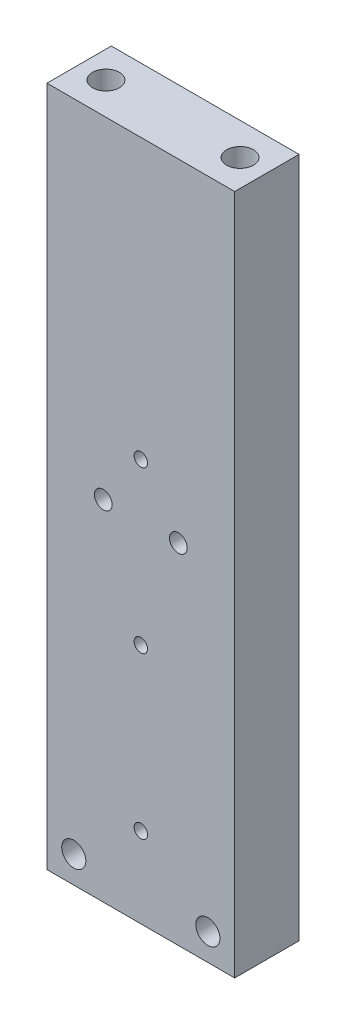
ISO-10303-21;
HEADER;
FILE_DESCRIPTION(('STEP AP214'),'2;1');
FILE_NAME('part.step','',(''),(''),'','','');
FILE_SCHEMA(('AUTOMOTIVE_DESIGN { 1 0 10303 214 1 1 1 1 }'));
ENDSEC;
DATA;
#1=APPLICATION_CONTEXT('core data for automotive mechanical design processes');
#2=APPLICATION_PROTOCOL_DEFINITION('international standard','automotive_design',2000,#1);
#3=PRODUCT_CONTEXT('',#1,'mechanical');
#4=PRODUCT('Part','Part','',(#3));
#5=PRODUCT_RELATED_PRODUCT_CATEGORY('part','',(#4));
#6=PRODUCT_DEFINITION_FORMATION('','',#4);
#7=PRODUCT_DEFINITION_CONTEXT('part definition',#1,'design');
#8=PRODUCT_DEFINITION('design','',#6,#7);
#9=PRODUCT_DEFINITION_SHAPE('','',#8);
#10=(LENGTH_UNIT() NAMED_UNIT(*) SI_UNIT(.MILLI.,.METRE.));
#11=(NAMED_UNIT(*) PLANE_ANGLE_UNIT() SI_UNIT($,.RADIAN.));
#12=(NAMED_UNIT(*) SI_UNIT($,.STERADIAN.) SOLID_ANGLE_UNIT());
#13=UNCERTAINTY_MEASURE_WITH_UNIT(LENGTH_MEASURE(1.E-05),#10,'distance_accuracy_value','');
#14=(GEOMETRIC_REPRESENTATION_CONTEXT(3) GLOBAL_UNCERTAINTY_ASSIGNED_CONTEXT((#13)) GLOBAL_UNIT_ASSIGNED_CONTEXT((#10,
#11,#12)) REPRESENTATION_CONTEXT('',''));
#15=CARTESIAN_POINT('',(0.,0.,0.));
#16=DIRECTION('',(0.,0.,1.));
#17=DIRECTION('',(1.,0.,0.));
#18=AXIS2_PLACEMENT_3D('',#15,#16,#17);
#19=CARTESIAN_POINT('',(-12.5,48.4999999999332,6.));
#20=DIRECTION('',(0.,1.,0.));
#21=DIRECTION('',(-1.,0.,0.));
#22=AXIS2_PLACEMENT_3D('',#19,#20,#21);
#23=CONICAL_SURFACE('',#22,2.49999999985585,1.02974425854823);
#24=CARTESIAN_POINT('',(-12.5,46.9978484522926,5.99999999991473));
#25=VERTEX_POINT('',#24);
#26=VERTEX_LOOP('',#25);
#27=FACE_BOUND('',#26,.T.);
#28=CARTESIAN_POINT('',(-12.5,48.5,6.));
#29=DIRECTION('',(0.,1.,0.));
#30=DIRECTION('',(0.,0.,1.));
#31=AXIS2_PLACEMENT_3D('',#28,#29,#30);
#32=CIRCLE('',#31,2.5);
#33=CARTESIAN_POINT('',(-12.5,48.5,8.5));
#34=VERTEX_POINT('',#33);
#35=EDGE_CURVE('E66',#34,#34,#32,.T.);
#36=ORIENTED_EDGE('',*,*,#35,.T.);
#37=EDGE_LOOP('',(#36));
#38=FACE_BOUND('',#37,.T.);
#39=ADVANCED_FACE('F17',(#27,#38),#23,.F.);
#40=CARTESIAN_POINT('',(12.5,48.4999999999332,6.));
#41=DIRECTION('',(0.,1.,0.));
#42=DIRECTION('',(-1.,0.,0.));
#43=AXIS2_PLACEMENT_3D('',#40,#41,#42);
#44=CONICAL_SURFACE('',#43,2.49999999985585,1.02974425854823);
#45=CARTESIAN_POINT('',(12.5,46.9978484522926,5.99999999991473));
#46=VERTEX_POINT('',#45);
#47=VERTEX_LOOP('',#46);
#48=FACE_BOUND('',#47,.T.);
#49=CARTESIAN_POINT('',(12.5,48.5,6.));
#50=DIRECTION('',(0.,1.,0.));
#51=DIRECTION('',(0.,0.,1.));
#52=AXIS2_PLACEMENT_3D('',#49,#50,#51);
#53=CIRCLE('',#52,2.5);
#54=CARTESIAN_POINT('',(12.5,48.5,8.5));
#55=VERTEX_POINT('',#54);
#56=EDGE_CURVE('E68',#55,#55,#53,.T.);
#57=ORIENTED_EDGE('',*,*,#56,.T.);
#58=EDGE_LOOP('',(#57));
#59=FACE_BOUND('',#58,.T.);
#60=ADVANCED_FACE('F63',(#48,#59),#44,.F.);
#61=CARTESIAN_POINT('',(-12.5,-58.5,4.));
#62=DIRECTION('',(0.,0.,-1.));
#63=DIRECTION('',(-1.,0.,0.));
#64=AXIS2_PLACEMENT_3D('',#61,#62,#63);
#65=CYLINDRICAL_SURFACE('',#64,3.75);
#66=CARTESIAN_POINT('',(-12.5,-58.5,4.));
#67=DIRECTION('',(0.,0.,-1.));
#68=DIRECTION('',(-1.,0.,0.));
#69=AXIS2_PLACEMENT_3D('',#66,#67,#68);
#70=CIRCLE('',#69,3.75);
#71=CARTESIAN_POINT('',(-16.25,-58.5,4.));
#72=VERTEX_POINT('',#71);
#73=EDGE_CURVE('E20',#72,#72,#70,.T.);
#74=ORIENTED_EDGE('',*,*,#73,.F.);
#75=EDGE_LOOP('',(#74));
#76=FACE_BOUND('',#75,.T.);
#77=CARTESIAN_POINT('',(-12.5,-58.5,0.));
#78=DIRECTION('',(0.,0.,-1.));
#79=DIRECTION('',(-1.,0.,0.));
#80=AXIS2_PLACEMENT_3D('',#77,#78,#79);
#81=CIRCLE('',#80,3.75);
#82=CARTESIAN_POINT('',(-16.25,-58.5,0.));
#83=VERTEX_POINT('',#82);
#84=EDGE_CURVE('E72',#83,#83,#81,.T.);
#85=ORIENTED_EDGE('',*,*,#84,.T.);
#86=EDGE_LOOP('',(#85));
#87=FACE_BOUND('',#86,.T.);
#88=ADVANCED_FACE('F135',(#76,#87),#65,.F.);
#89=CARTESIAN_POINT('',(12.5,-58.5,4.));
#90=DIRECTION('',(0.,0.,-1.));
#91=DIRECTION('',(-1.,0.,0.));
#92=AXIS2_PLACEMENT_3D('',#89,#90,#91);
#93=CYLINDRICAL_SURFACE('',#92,3.75);
#94=CARTESIAN_POINT('',(12.5,-58.5,4.));
#95=DIRECTION('',(0.,0.,-1.));
#96=DIRECTION('',(-1.,0.,0.));
#97=AXIS2_PLACEMENT_3D('',#94,#95,#96);
#98=CIRCLE('',#97,3.75);
#99=CARTESIAN_POINT('',(8.75000000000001,-58.5,4.));
#100=VERTEX_POINT('',#99);
#101=EDGE_CURVE('E69',#100,#100,#98,.T.);
#102=ORIENTED_EDGE('',*,*,#101,.F.);
#103=EDGE_LOOP('',(#102));
#104=FACE_BOUND('',#103,.T.);
#105=CARTESIAN_POINT('',(12.5,-58.5,0.));
#106=DIRECTION('',(0.,0.,-1.));
#107=DIRECTION('',(-1.,0.,0.));
#108=AXIS2_PLACEMENT_3D('',#105,#106,#107);
#109=CIRCLE('',#108,3.75);
#110=CARTESIAN_POINT('',(8.75000000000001,-58.5,0.));
#111=VERTEX_POINT('',#110);
#112=EDGE_CURVE('E129',#111,#111,#109,.T.);
#113=ORIENTED_EDGE('',*,*,#112,.T.);
#114=EDGE_LOOP('',(#113));
#115=FACE_BOUND('',#114,.T.);
#116=ADVANCED_FACE('F219',(#104,#115),#93,.F.);
#117=CARTESIAN_POINT('',(-12.5,-58.5,4.));
#118=DIRECTION('',(0.,0.,-1.));
#119=DIRECTION('',(-1.,0.,0.));
#120=AXIS2_PLACEMENT_3D('',#117,#118,#119);
#121=PLANE('',#120);
#122=CARTESIAN_POINT('',(-12.5,-58.5,4.));
#123=DIRECTION('',(0.,0.,-1.));
#124=DIRECTION('',(-1.,0.,0.));
#125=AXIS2_PLACEMENT_3D('',#122,#123,#124);
#126=CIRCLE('',#125,2.25);
#127=CARTESIAN_POINT('',(-14.75,-58.5,4.));
#128=VERTEX_POINT('',#127);
#129=EDGE_CURVE('E126',#128,#128,#126,.F.);
#130=ORIENTED_EDGE('',*,*,#129,.T.);
#131=EDGE_LOOP('',(#130));
#132=FACE_BOUND('',#131,.T.);
#133=ORIENTED_EDGE('',*,*,#73,.T.);
#134=EDGE_LOOP('',(#133));
#135=FACE_BOUND('',#134,.T.);
#136=ADVANCED_FACE('F215',(#132,#135),#121,.T.);
#137=CARTESIAN_POINT('',(12.5,-58.5,4.));
#138=DIRECTION('',(0.,0.,-1.));
#139=DIRECTION('',(-1.,0.,0.));
#140=AXIS2_PLACEMENT_3D('',#137,#138,#139);
#141=PLANE('',#140);
#142=CARTESIAN_POINT('',(12.5,-58.5,4.));
#143=DIRECTION('',(0.,0.,-1.));
#144=DIRECTION('',(-1.,0.,0.));
#145=AXIS2_PLACEMENT_3D('',#142,#143,#144);
#146=CIRCLE('',#145,2.25);
#147=CARTESIAN_POINT('',(10.25,-58.5,4.));
#148=VERTEX_POINT('',#147);
#149=EDGE_CURVE('E123',#148,#148,#146,.F.);
#150=ORIENTED_EDGE('',*,*,#149,.T.);
#151=EDGE_LOOP('',(#150));
#152=FACE_BOUND('',#151,.T.);
#153=ORIENTED_EDGE('',*,*,#101,.T.);
#154=EDGE_LOOP('',(#153));
#155=FACE_BOUND('',#154,.T.);
#156=ADVANCED_FACE('F212',(#152,#155),#141,.T.);
#157=CARTESIAN_POINT('',(-12.5,63.5,6.));
#158=DIRECTION('',(0.,1.,0.));
#159=DIRECTION('',(0.,0.,1.));
#160=AXIS2_PLACEMENT_3D('',#157,#158,#159);
#161=CYLINDRICAL_SURFACE('',#160,2.5);
#162=ORIENTED_EDGE('',*,*,#35,.F.);
#163=EDGE_LOOP('',(#162));
#164=FACE_BOUND('',#163,.T.);
#165=CARTESIAN_POINT('',(-12.5,63.5,6.));
#166=DIRECTION('',(0.,1.,0.));
#167=DIRECTION('',(0.,0.,1.));
#168=AXIS2_PLACEMENT_3D('',#165,#166,#167);
#169=CIRCLE('',#168,2.5);
#170=CARTESIAN_POINT('',(-12.5,63.5,8.5));
#171=VERTEX_POINT('',#170);
#172=EDGE_CURVE('E104',#171,#171,#169,.T.);
#173=ORIENTED_EDGE('',*,*,#172,.T.);
#174=EDGE_LOOP('',(#173));
#175=FACE_BOUND('',#174,.T.);
#176=ADVANCED_FACE('F151',(#164,#175),#161,.F.);
#177=CARTESIAN_POINT('',(12.5,63.5,6.));
#178=DIRECTION('',(0.,1.,0.));
#179=DIRECTION('',(0.,0.,1.));
#180=AXIS2_PLACEMENT_3D('',#177,#178,#179);
#181=CYLINDRICAL_SURFACE('',#180,2.5);
#182=ORIENTED_EDGE('',*,*,#56,.F.);
#183=EDGE_LOOP('',(#182));
#184=FACE_BOUND('',#183,.T.);
#185=CARTESIAN_POINT('',(12.5,63.5,6.));
#186=DIRECTION('',(0.,1.,0.));
#187=DIRECTION('',(0.,0.,1.));
#188=AXIS2_PLACEMENT_3D('',#185,#186,#187);
#189=CIRCLE('',#188,2.5);
#190=CARTESIAN_POINT('',(12.5,63.5,8.5));
#191=VERTEX_POINT('',#190);
#192=EDGE_CURVE('E100',#191,#191,#189,.T.);
#193=ORIENTED_EDGE('',*,*,#192,.T.);
#194=EDGE_LOOP('',(#193));
#195=FACE_BOUND('',#194,.T.);
#196=ADVANCED_FACE('F140',(#184,#195),#181,.F.);
#197=CARTESIAN_POINT('',(0.,0.,0.));
#198=DIRECTION('',(0.,0.,1.));
#199=DIRECTION('',(1.,0.,0.));
#200=AXIS2_PLACEMENT_3D('',#197,#198,#199);
#201=PLANE('',#200);
#202=DIRECTION('',(1.,0.,0.));
#203=VECTOR('',#202,1.);
#204=CARTESIAN_POINT('',(-17.5,-63.5,0.));
#205=LINE('',#204,#203);
#206=CARTESIAN_POINT('',(17.5,-63.5,0.));
#207=VERTEX_POINT('',#206);
#208=CARTESIAN_POINT('',(-17.5,-63.5,0.));
#209=VERTEX_POINT('',#208);
#210=EDGE_CURVE('E99',#207,#209,#205,.F.);
#211=ORIENTED_EDGE('',*,*,#210,.T.);
#212=DIRECTION('',(0.,1.,0.));
#213=VECTOR('',#212,1.);
#214=CARTESIAN_POINT('',(-17.5,63.5,0.));
#215=LINE('',#214,#213);
#216=CARTESIAN_POINT('',(-17.5,63.5,0.));
#217=VERTEX_POINT('',#216);
#218=EDGE_CURVE('E457',#209,#217,#215,.T.);
#219=ORIENTED_EDGE('',*,*,#218,.T.);
#220=DIRECTION('',(1.,0.,0.));
#221=VECTOR('',#220,1.);
#222=CARTESIAN_POINT('',(-17.5,63.5,0.));
#223=LINE('',#222,#221);
#224=CARTESIAN_POINT('',(17.5,63.5,0.));
#225=VERTEX_POINT('',#224);
#226=EDGE_CURVE('E443',#217,#225,#223,.T.);
#227=ORIENTED_EDGE('',*,*,#226,.T.);
#228=DIRECTION('',(0.,-1.,0.));
#229=VECTOR('',#228,1.);
#230=CARTESIAN_POINT('',(17.5,63.5,0.));
#231=LINE('',#230,#229);
#232=EDGE_CURVE('E107',#225,#207,#231,.T.);
#233=ORIENTED_EDGE('',*,*,#232,.T.);
#234=EDGE_LOOP('',(#211,#219,#227,#233));
#235=FACE_BOUND('',#234,.T.);
#236=CARTESIAN_POINT('',(0.,11.5,0.));
#237=DIRECTION('',(0.,0.,1.));
#238=DIRECTION('',(1.,0.,0.));
#239=AXIS2_PLACEMENT_3D('',#236,#237,#238);
#240=CIRCLE('',#239,1.24999999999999);
#241=CARTESIAN_POINT('',(1.24999999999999,11.5,0.));
#242=VERTEX_POINT('',#241);
#243=EDGE_CURVE('E108',#242,#242,#240,.T.);
#244=ORIENTED_EDGE('',*,*,#243,.T.);
#245=EDGE_LOOP('',(#244));
#246=FACE_BOUND('',#245,.T.);
#247=CARTESIAN_POINT('',(0.,-18.5,0.));
#248=DIRECTION('',(0.,0.,1.));
#249=DIRECTION('',(1.,0.,0.));
#250=AXIS2_PLACEMENT_3D('',#247,#248,#249);
#251=CIRCLE('',#250,1.24999999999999);
#252=CARTESIAN_POINT('',(1.24999999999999,-18.5,0.));
#253=VERTEX_POINT('',#252);
#254=EDGE_CURVE('E111',#253,#253,#251,.T.);
#255=ORIENTED_EDGE('',*,*,#254,.T.);
#256=EDGE_LOOP('',(#255));
#257=FACE_BOUND('',#256,.T.);
#258=CARTESIAN_POINT('',(0.,-48.5,0.));
#259=DIRECTION('',(0.,0.,1.));
#260=DIRECTION('',(1.,0.,0.));
#261=AXIS2_PLACEMENT_3D('',#258,#259,#260);
#262=CIRCLE('',#261,1.24999999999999);
#263=CARTESIAN_POINT('',(1.24999999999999,-48.5,0.));
#264=VERTEX_POINT('',#263);
#265=EDGE_CURVE('E114',#264,#264,#262,.T.);
#266=ORIENTED_EDGE('',*,*,#265,.T.);
#267=EDGE_LOOP('',(#266));
#268=FACE_BOUND('',#267,.T.);
#269=CARTESIAN_POINT('',(7.,1.49999999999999,0.));
#270=DIRECTION('',(0.,0.,1.));
#271=DIRECTION('',(1.,0.,0.));
#272=AXIS2_PLACEMENT_3D('',#269,#270,#271);
#273=CIRCLE('',#272,1.64999999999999);
#274=CARTESIAN_POINT('',(8.64999999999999,1.49999999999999,0.));
#275=VERTEX_POINT('',#274);
#276=EDGE_CURVE('E117',#275,#275,#273,.T.);
#277=ORIENTED_EDGE('',*,*,#276,.T.);
#278=EDGE_LOOP('',(#277));
#279=FACE_BOUND('',#278,.T.);
#280=CARTESIAN_POINT('',(-7.,1.49999999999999,0.));
#281=DIRECTION('',(0.,0.,1.));
#282=DIRECTION('',(1.,0.,0.));
#283=AXIS2_PLACEMENT_3D('',#280,#281,#282);
#284=CIRCLE('',#283,1.64999999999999);
#285=CARTESIAN_POINT('',(-5.35000000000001,1.49999999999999,0.));
#286=VERTEX_POINT('',#285);
#287=EDGE_CURVE('E120',#286,#286,#284,.T.);
#288=ORIENTED_EDGE('',*,*,#287,.T.);
#289=EDGE_LOOP('',(#288));
#290=FACE_BOUND('',#289,.T.);
#291=ORIENTED_EDGE('',*,*,#112,.F.);
#292=EDGE_LOOP('',(#291));
#293=FACE_BOUND('',#292,.T.);
#294=ORIENTED_EDGE('',*,*,#84,.F.);
#295=EDGE_LOOP('',(#294));
#296=FACE_BOUND('',#295,.T.);
#297=ADVANCED_FACE('F137',(#235,#246,#257,#268,#279,#290,#293,#296),#201,.F.);
#298=CARTESIAN_POINT('',(-12.5,-58.5,12.));
#299=DIRECTION('',(0.,0.,-1.));
#300=DIRECTION('',(-1.,0.,0.));
#301=AXIS2_PLACEMENT_3D('',#298,#299,#300);
#302=CYLINDRICAL_SURFACE('',#301,2.25);
#303=ORIENTED_EDGE('',*,*,#129,.F.);
#304=EDGE_LOOP('',(#303));
#305=FACE_BOUND('',#304,.T.);
#306=CARTESIAN_POINT('',(-12.5,-58.5,12.));
#307=DIRECTION('',(0.,0.,-1.));
#308=DIRECTION('',(-1.,0.,0.));
#309=AXIS2_PLACEMENT_3D('',#306,#307,#308);
#310=CIRCLE('',#309,2.25);
#311=CARTESIAN_POINT('',(-14.75,-58.5,12.));
#312=VERTEX_POINT('',#311);
#313=EDGE_CURVE('E96',#312,#312,#310,.T.);
#314=ORIENTED_EDGE('',*,*,#313,.F.);
#315=EDGE_LOOP('',(#314));
#316=FACE_BOUND('',#315,.T.);
#317=ADVANCED_FACE('F139',(#305,#316),#302,.F.);
#318=CARTESIAN_POINT('',(12.5,-58.5,12.));
#319=DIRECTION('',(0.,0.,-1.));
#320=DIRECTION('',(-1.,0.,0.));
#321=AXIS2_PLACEMENT_3D('',#318,#319,#320);
#322=CYLINDRICAL_SURFACE('',#321,2.25);
#323=ORIENTED_EDGE('',*,*,#149,.F.);
#324=EDGE_LOOP('',(#323));
#325=FACE_BOUND('',#324,.T.);
#326=CARTESIAN_POINT('',(12.5,-58.5,12.));
#327=DIRECTION('',(0.,0.,-1.));
#328=DIRECTION('',(-1.,0.,0.));
#329=AXIS2_PLACEMENT_3D('',#326,#327,#328);
#330=CIRCLE('',#329,2.25);
#331=CARTESIAN_POINT('',(10.25,-58.5,12.));
#332=VERTEX_POINT('',#331);
#333=EDGE_CURVE('E93',#332,#332,#330,.T.);
#334=ORIENTED_EDGE('',*,*,#333,.F.);
#335=EDGE_LOOP('',(#334));
#336=FACE_BOUND('',#335,.T.);
#337=ADVANCED_FACE('F148',(#325,#336),#322,.F.);
#338=CARTESIAN_POINT('',(-7.,1.49999999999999,12.));
#339=DIRECTION('',(0.,0.,1.));
#340=DIRECTION('',(1.,0.,0.));
#341=AXIS2_PLACEMENT_3D('',#338,#339,#340);
#342=CYLINDRICAL_SURFACE('',#341,1.64999999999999);
#343=CARTESIAN_POINT('',(-7.,1.49999999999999,12.));
#344=DIRECTION('',(0.,0.,1.));
#345=DIRECTION('',(1.,0.,0.));
#346=AXIS2_PLACEMENT_3D('',#343,#344,#345);
#347=CIRCLE('',#346,1.64999999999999);
#348=CARTESIAN_POINT('',(-5.35000000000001,1.49999999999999,12.));
#349=VERTEX_POINT('',#348);
#350=EDGE_CURVE('E90',#349,#349,#347,.F.);
#351=ORIENTED_EDGE('',*,*,#350,.F.);
#352=EDGE_LOOP('',(#351));
#353=FACE_BOUND('',#352,.T.);
#354=ORIENTED_EDGE('',*,*,#287,.F.);
#355=EDGE_LOOP('',(#354));
#356=FACE_BOUND('',#355,.T.);
#357=ADVANCED_FACE('F195',(#353,#356),#342,.F.);
#358=CARTESIAN_POINT('',(7.,1.49999999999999,12.));
#359=DIRECTION('',(0.,0.,1.));
#360=DIRECTION('',(1.,0.,0.));
#361=AXIS2_PLACEMENT_3D('',#358,#359,#360);
#362=CYLINDRICAL_SURFACE('',#361,1.64999999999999);
#363=CARTESIAN_POINT('',(7.,1.49999999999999,12.));
#364=DIRECTION('',(0.,0.,1.));
#365=DIRECTION('',(1.,0.,0.));
#366=AXIS2_PLACEMENT_3D('',#363,#364,#365);
#367=CIRCLE('',#366,1.64999999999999);
#368=CARTESIAN_POINT('',(8.64999999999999,1.49999999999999,12.));
#369=VERTEX_POINT('',#368);
#370=EDGE_CURVE('E87',#369,#369,#367,.F.);
#371=ORIENTED_EDGE('',*,*,#370,.F.);
#372=EDGE_LOOP('',(#371));
#373=FACE_BOUND('',#372,.T.);
#374=ORIENTED_EDGE('',*,*,#276,.F.);
#375=EDGE_LOOP('',(#374));
#376=FACE_BOUND('',#375,.T.);
#377=ADVANCED_FACE('F191',(#373,#376),#362,.F.);
#378=CARTESIAN_POINT('',(0.,-48.5,12.));
#379=DIRECTION('',(0.,0.,1.));
#380=DIRECTION('',(1.,0.,0.));
#381=AXIS2_PLACEMENT_3D('',#378,#379,#380);
#382=CYLINDRICAL_SURFACE('',#381,1.24999999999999);
#383=CARTESIAN_POINT('',(0.,-48.5,12.));
#384=DIRECTION('',(0.,0.,1.));
#385=DIRECTION('',(1.,0.,0.));
#386=AXIS2_PLACEMENT_3D('',#383,#384,#385);
#387=CIRCLE('',#386,1.24999999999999);
#388=CARTESIAN_POINT('',(1.24999999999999,-48.5,12.));
#389=VERTEX_POINT('',#388);
#390=EDGE_CURVE('E84',#389,#389,#387,.F.);
#391=ORIENTED_EDGE('',*,*,#390,.F.);
#392=EDGE_LOOP('',(#391));
#393=FACE_BOUND('',#392,.T.);
#394=ORIENTED_EDGE('',*,*,#265,.F.);
#395=EDGE_LOOP('',(#394));
#396=FACE_BOUND('',#395,.T.);
#397=ADVANCED_FACE('F187',(#393,#396),#382,.F.);
#398=CARTESIAN_POINT('',(0.,-18.5,12.));
#399=DIRECTION('',(0.,0.,1.));
#400=DIRECTION('',(1.,0.,0.));
#401=AXIS2_PLACEMENT_3D('',#398,#399,#400);
#402=CYLINDRICAL_SURFACE('',#401,1.24999999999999);
#403=CARTESIAN_POINT('',(0.,-18.5,12.));
#404=DIRECTION('',(0.,0.,1.));
#405=DIRECTION('',(1.,0.,0.));
#406=AXIS2_PLACEMENT_3D('',#403,#404,#405);
#407=CIRCLE('',#406,1.24999999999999);
#408=CARTESIAN_POINT('',(1.24999999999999,-18.5,12.));
#409=VERTEX_POINT('',#408);
#410=EDGE_CURVE('E81',#409,#409,#407,.F.);
#411=ORIENTED_EDGE('',*,*,#410,.F.);
#412=EDGE_LOOP('',(#411));
#413=FACE_BOUND('',#412,.T.);
#414=ORIENTED_EDGE('',*,*,#254,.F.);
#415=EDGE_LOOP('',(#414));
#416=FACE_BOUND('',#415,.T.);
#417=ADVANCED_FACE('F183',(#413,#416),#402,.F.);
#418=CARTESIAN_POINT('',(0.,11.5,12.));
#419=DIRECTION('',(0.,0.,1.));
#420=DIRECTION('',(1.,0.,0.));
#421=AXIS2_PLACEMENT_3D('',#418,#419,#420);
#422=CYLINDRICAL_SURFACE('',#421,1.24999999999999);
#423=CARTESIAN_POINT('',(0.,11.5,12.));
#424=DIRECTION('',(0.,0.,1.));
#425=DIRECTION('',(1.,0.,0.));
#426=AXIS2_PLACEMENT_3D('',#423,#424,#425);
#427=CIRCLE('',#426,1.24999999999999);
#428=CARTESIAN_POINT('',(1.24999999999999,11.5,12.));
#429=VERTEX_POINT('',#428);
#430=EDGE_CURVE('E77',#429,#429,#427,.F.);
#431=ORIENTED_EDGE('',*,*,#430,.F.);
#432=EDGE_LOOP('',(#431));
#433=FACE_BOUND('',#432,.T.);
#434=ORIENTED_EDGE('',*,*,#243,.F.);
#435=EDGE_LOOP('',(#434));
#436=FACE_BOUND('',#435,.T.);
#437=ADVANCED_FACE('F179',(#433,#436),#422,.F.);
#438=CARTESIAN_POINT('',(17.5,63.5,12.));
#439=DIRECTION('',(-1.,0.,0.));
#440=DIRECTION('',(0.,-1.,0.));
#441=AXIS2_PLACEMENT_3D('',#438,#439,#440);
#442=PLANE('',#441);
#443=DIRECTION('',(0.,0.,-1.));
#444=VECTOR('',#443,1.);
#445=CARTESIAN_POINT('',(17.5,63.5,12.));
#446=LINE('',#445,#444);
#447=CARTESIAN_POINT('',(17.5,63.5,12.));
#448=VERTEX_POINT('',#447);
#449=EDGE_CURVE('E103',#225,#448,#446,.F.);
#450=ORIENTED_EDGE('',*,*,#449,.T.);
#451=DIRECTION('',(0.,1.,0.));
#452=VECTOR('',#451,1.);
#453=CARTESIAN_POINT('',(17.5,0.,12.));
#454=LINE('',#453,#452);
#455=CARTESIAN_POINT('',(17.5,-63.5,12.));
#456=VERTEX_POINT('',#455);
#457=EDGE_CURVE('E80',#456,#448,#454,.T.);
#458=ORIENTED_EDGE('',*,*,#457,.F.);
#459=DIRECTION('',(0.,0.,1.));
#460=VECTOR('',#459,1.);
#461=CARTESIAN_POINT('',(17.5,-63.5,12.));
#462=LINE('',#461,#460);
#463=EDGE_CURVE('E454',#456,#207,#462,.F.);
#464=ORIENTED_EDGE('',*,*,#463,.T.);
#465=ORIENTED_EDGE('',*,*,#232,.F.);
#466=EDGE_LOOP('',(#450,#458,#464,#465));
#467=FACE_BOUND('',#466,.T.);
#468=ADVANCED_FACE('F175',(#467),#442,.F.);
#469=CARTESIAN_POINT('',(-17.5,63.5,12.));
#470=DIRECTION('',(0.,-1.,0.));
#471=DIRECTION('',(0.,0.,-1.));
#472=AXIS2_PLACEMENT_3D('',#469,#470,#471);
#473=PLANE('',#472);
#474=DIRECTION('',(0.,0.,1.));
#475=VECTOR('',#474,1.);
#476=CARTESIAN_POINT('',(-17.5,63.5,12.));
#477=LINE('',#476,#475);
#478=CARTESIAN_POINT('',(-17.5,63.5,12.));
#479=VERTEX_POINT('',#478);
#480=EDGE_CURVE('E448',#217,#479,#477,.T.);
#481=ORIENTED_EDGE('',*,*,#480,.T.);
#482=DIRECTION('',(1.,0.,0.));
#483=VECTOR('',#482,1.);
#484=CARTESIAN_POINT('',(0.,63.5,12.));
#485=LINE('',#484,#483);
#486=EDGE_CURVE('E446',#448,#479,#485,.F.);
#487=ORIENTED_EDGE('',*,*,#486,.F.);
#488=ORIENTED_EDGE('',*,*,#449,.F.);
#489=ORIENTED_EDGE('',*,*,#226,.F.);
#490=EDGE_LOOP('',(#481,#487,#488,#489));
#491=FACE_BOUND('',#490,.T.);
#492=ORIENTED_EDGE('',*,*,#192,.F.);
#493=EDGE_LOOP('',(#492));
#494=FACE_BOUND('',#493,.T.);
#495=ORIENTED_EDGE('',*,*,#172,.F.);
#496=EDGE_LOOP('',(#495));
#497=FACE_BOUND('',#496,.T.);
#498=ADVANCED_FACE('F172',(#491,#494,#497),#473,.F.);
#499=CARTESIAN_POINT('',(-17.5,63.5,12.));
#500=DIRECTION('',(1.,0.,0.));
#501=DIRECTION('',(0.,1.,0.));
#502=AXIS2_PLACEMENT_3D('',#499,#500,#501);
#503=PLANE('',#502);
#504=DIRECTION('',(0.,0.,1.));
#505=VECTOR('',#504,1.);
#506=CARTESIAN_POINT('',(-17.5,-63.5,12.));
#507=LINE('',#506,#505);
#508=CARTESIAN_POINT('',(-17.5,-63.5,12.));
#509=VERTEX_POINT('',#508);
#510=EDGE_CURVE('E35',#209,#509,#507,.T.);
#511=ORIENTED_EDGE('',*,*,#510,.T.);
#512=DIRECTION('',(0.,1.,0.));
#513=VECTOR('',#512,1.);
#514=CARTESIAN_POINT('',(-17.5,0.,12.));
#515=LINE('',#514,#513);
#516=EDGE_CURVE('E26',#479,#509,#515,.F.);
#517=ORIENTED_EDGE('',*,*,#516,.F.);
#518=ORIENTED_EDGE('',*,*,#480,.F.);
#519=ORIENTED_EDGE('',*,*,#218,.F.);
#520=EDGE_LOOP('',(#511,#517,#518,#519));
#521=FACE_BOUND('',#520,.T.);
#522=ADVANCED_FACE('F164',(#521),#503,.F.);
#523=CARTESIAN_POINT('',(-17.5,-63.5,12.));
#524=DIRECTION('',(0.,1.,0.));
#525=DIRECTION('',(0.,0.,1.));
#526=AXIS2_PLACEMENT_3D('',#523,#524,#525);
#527=PLANE('',#526);
#528=ORIENTED_EDGE('',*,*,#463,.F.);
#529=DIRECTION('',(1.,0.,0.));
#530=VECTOR('',#529,1.);
#531=CARTESIAN_POINT('',(0.,-63.5,12.));
#532=LINE('',#531,#530);
#533=EDGE_CURVE('E11',#509,#456,#532,.T.);
#534=ORIENTED_EDGE('',*,*,#533,.F.);
#535=ORIENTED_EDGE('',*,*,#510,.F.);
#536=ORIENTED_EDGE('',*,*,#210,.F.);
#537=EDGE_LOOP('',(#528,#534,#535,#536));
#538=FACE_BOUND('',#537,.T.);
#539=ADVANCED_FACE('F158',(#538),#527,.F.);
#540=CARTESIAN_POINT('',(0.,0.,12.));
#541=DIRECTION('',(0.,0.,1.));
#542=DIRECTION('',(1.,0.,0.));
#543=AXIS2_PLACEMENT_3D('',#540,#541,#542);
#544=PLANE('',#543);
#545=ORIENTED_EDGE('',*,*,#516,.T.);
#546=ORIENTED_EDGE('',*,*,#533,.T.);
#547=ORIENTED_EDGE('',*,*,#457,.T.);
#548=ORIENTED_EDGE('',*,*,#486,.T.);
#549=EDGE_LOOP('',(#545,#546,#547,#548));
#550=FACE_BOUND('',#549,.T.);
#551=ORIENTED_EDGE('',*,*,#430,.T.);
#552=EDGE_LOOP('',(#551));
#553=FACE_BOUND('',#552,.T.);
#554=ORIENTED_EDGE('',*,*,#410,.T.);
#555=EDGE_LOOP('',(#554));
#556=FACE_BOUND('',#555,.T.);
#557=ORIENTED_EDGE('',*,*,#390,.T.);
#558=EDGE_LOOP('',(#557));
#559=FACE_BOUND('',#558,.T.);
#560=ORIENTED_EDGE('',*,*,#370,.T.);
#561=EDGE_LOOP('',(#560));
#562=FACE_BOUND('',#561,.T.);
#563=ORIENTED_EDGE('',*,*,#350,.T.);
#564=EDGE_LOOP('',(#563));
#565=FACE_BOUND('',#564,.T.);
#566=ORIENTED_EDGE('',*,*,#333,.T.);
#567=EDGE_LOOP('',(#566));
#568=FACE_BOUND('',#567,.T.);
#569=ORIENTED_EDGE('',*,*,#313,.T.);
#570=EDGE_LOOP('',(#569));
#571=FACE_BOUND('',#570,.T.);
#572=ADVANCED_FACE('F156',(#550,#553,#556,#559,#562,#565,#568,#571),#544,.T.);
#573=CLOSED_SHELL('',(#39,#60,#88,#116,#136,#156,#176,#196,#297,#317,#337,#357,#377,#397,#417,
#437,#468,#498,#522,#539,#572));
#574=MANIFOLD_SOLID_BREP('B1',#573);
#575=ADVANCED_BREP_SHAPE_REPRESENTATION('',(#18,#574),#14);
#576=SHAPE_DEFINITION_REPRESENTATION(#9,#575);
ENDSEC;
END-ISO-10303-21;
